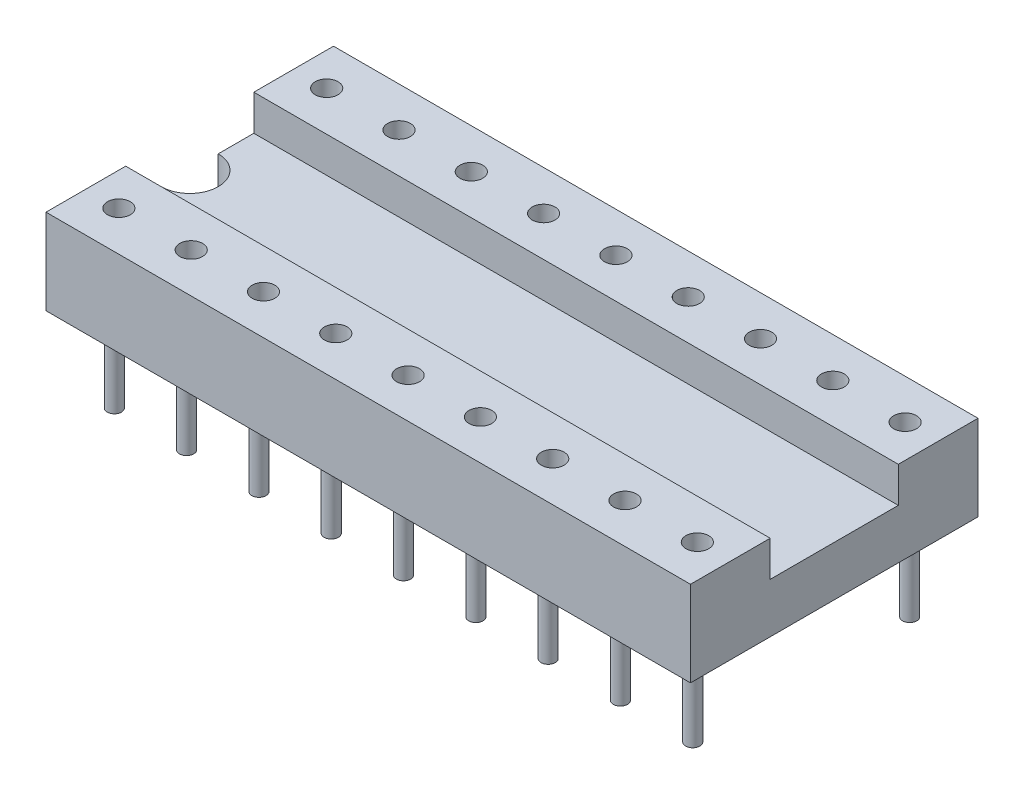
from build123d import *

# Parameters (mm, degrees)
EXTRUSION1_DEPTH        = 22.64
ENL_V_MAT_EXTRU_1_DEPTH = 24.262299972
ESQUISSE3_R             = 0.4
ENL_V_MAT_EXTRU_2_DEPTH = 2.5
ESQUISSE5_R             = 0.25
EXTRUSION2_DEPTH        = 3


with BuildPart() as part:
    # Esquisse1 → Extrusion1 (new body)
    with BuildSketch(Plane(origin=(0, 0, 0), x_dir=(0, 0, -1), z_dir=(1, 0, 0))):
        Polygon((-2.25, 1.75), (-2.25, 3), (-5.05, 3), (-5.05, 0), (5.05, 0), (5.05, 3), (2.25, 3), (2.25, 1.75), align=None)
    extrude(amount=EXTRUSION1_DEPTH)

    # Esquisse2 → Enl_v. mat.-Extru.1 (cut, through all)
    with BuildSketch(Plane(origin=(0, 1.75, 0), x_dir=(-1, 0, 0), z_dir=(0, 1, 0))):
        with BuildLine():
            Line((0, -1), (0, 1))
            ThreePointArc((0, 1), (-1, 0), (0, -1))
        make_face()
    extrude(amount=-ENL_V_MAT_EXTRU_1_DEPTH, mode=Mode.SUBTRACT)

    # Esquisse3 → Enl_v. mat.-Extru.2 (cut)
    with BuildSketch(Plane(origin=(0, 3, 0), x_dir=(-1, 0, 0), z_dir=(0, 1, 0))):
        with Locations(Location((-1.16, 3.65, 0), (0, 0, 90))):
            Circle(ESQUISSE3_R)
        with Locations(Location((-1.16, -3.65, 0), (0, 0, 270))):
            Circle(ESQUISSE3_R)
        with Locations(Location((-3.7, 3.65, 0), (0, 0, 90))):
            Circle(ESQUISSE3_R)
        with Locations(Location((-3.7, -3.65, 0), (0, 0, 270))):
            Circle(ESQUISSE3_R)
        with Locations(Location((-6.24, 3.65, 0), (0, 0, 90))):
            Circle(ESQUISSE3_R)
        with Locations(Location((-6.24, -3.65, 0), (0, 0, 270))):
            Circle(ESQUISSE3_R)
        with Locations(Location((-8.78, 3.65, 0), (0, 0, 90))):
            Circle(ESQUISSE3_R)
        with Locations(Location((-8.78, -3.65, 0), (0, 0, 270))):
            Circle(ESQUISSE3_R)
        with Locations(Location((-11.32, 3.65, 0), (0, 0, 90))):
            Circle(ESQUISSE3_R)
        with Locations(Location((-11.32, -3.65, 0), (0, 0, 270))):
            Circle(ESQUISSE3_R)
        with Locations(Location((-13.86, 3.65, 0), (0, 0, 90))):
            Circle(ESQUISSE3_R)
        with Locations(Location((-13.86, -3.65, 0), (0, 0, 270))):
            Circle(ESQUISSE3_R)
        with Locations(Location((-16.4, 3.65, 0), (0, 0, 90))):
            Circle(ESQUISSE3_R)
        with Locations(Location((-16.4, -3.65, 0), (0, 0, 270))):
            Circle(ESQUISSE3_R)
        with Locations(Location((-18.94, 3.65, 0), (0, 0, 90))):
            Circle(ESQUISSE3_R)
        with Locations(Location((-18.94, -3.65, 0), (0, 0, 270))):
            Circle(ESQUISSE3_R)
        with Locations(Location((-21.48, 3.65, 0), (0, 0, 90))):
            Circle(ESQUISSE3_R)
        with Locations(Location((-21.48, -3.65, 0), (0, 0, 270))):
            Circle(ESQUISSE3_R)
    extrude(amount=-ENL_V_MAT_EXTRU_2_DEPTH, mode=Mode.SUBTRACT)

    # Esquisse5 → Extrusion2 (add)
    with BuildSketch(Plane.XZ):
        with Locations(Location((1.16, 3.81, 0), (0, 0, 90))):
            Circle(ESQUISSE5_R)
        with Locations(Location((1.16, -3.81, 0), (0, 0, 90))):
            Circle(ESQUISSE5_R)
        with Locations(Location((3.7, -3.81, 0), (0, 0, 90))):
            Circle(ESQUISSE5_R)
        with Locations(Location((3.7, 3.81, 0), (0, 0, 90))):
            Circle(ESQUISSE5_R)
        with Locations(Location((6.24, -3.81, 0), (0, 0, 90))):
            Circle(ESQUISSE5_R)
        with Locations(Location((6.24, 3.81, 0), (0, 0, 90))):
            Circle(ESQUISSE5_R)
        with Locations(Location((8.78, -3.81, 0), (0, 0, 90))):
            Circle(ESQUISSE5_R)
        with Locations(Location((8.78, 3.81, 0), (0, 0, 90))):
            Circle(ESQUISSE5_R)
        with Locations(Location((11.32, -3.81, 0), (0, 0, 90))):
            Circle(ESQUISSE5_R)
        with Locations(Location((11.32, 3.81, 0), (0, 0, 90))):
            Circle(ESQUISSE5_R)
        with Locations(Location((13.86, -3.81, 0), (0, 0, 90))):
            Circle(ESQUISSE5_R)
        with Locations(Location((13.86, 3.81, 0), (0, 0, 90))):
            Circle(ESQUISSE5_R)
        with Locations(Location((16.4, -3.81, 0), (0, 0, 90))):
            Circle(ESQUISSE5_R)
        with Locations(Location((16.4, 3.81, 0), (0, 0, 90))):
            Circle(ESQUISSE5_R)
        with Locations(Location((18.94, -3.81, 0), (0, 0, 90))):
            Circle(ESQUISSE5_R)
        with Locations(Location((18.94, 3.81, 0), (0, 0, 90))):
            Circle(ESQUISSE5_R)
        with Locations(Location((21.48, -3.81, 0), (0, 0, 90))):
            Circle(ESQUISSE5_R)
        with Locations(Location((21.48, 3.81, 0), (0, 0, 90))):
            Circle(ESQUISSE5_R)
    extrude(amount=EXTRUSION2_DEPTH)


solid = part.part
